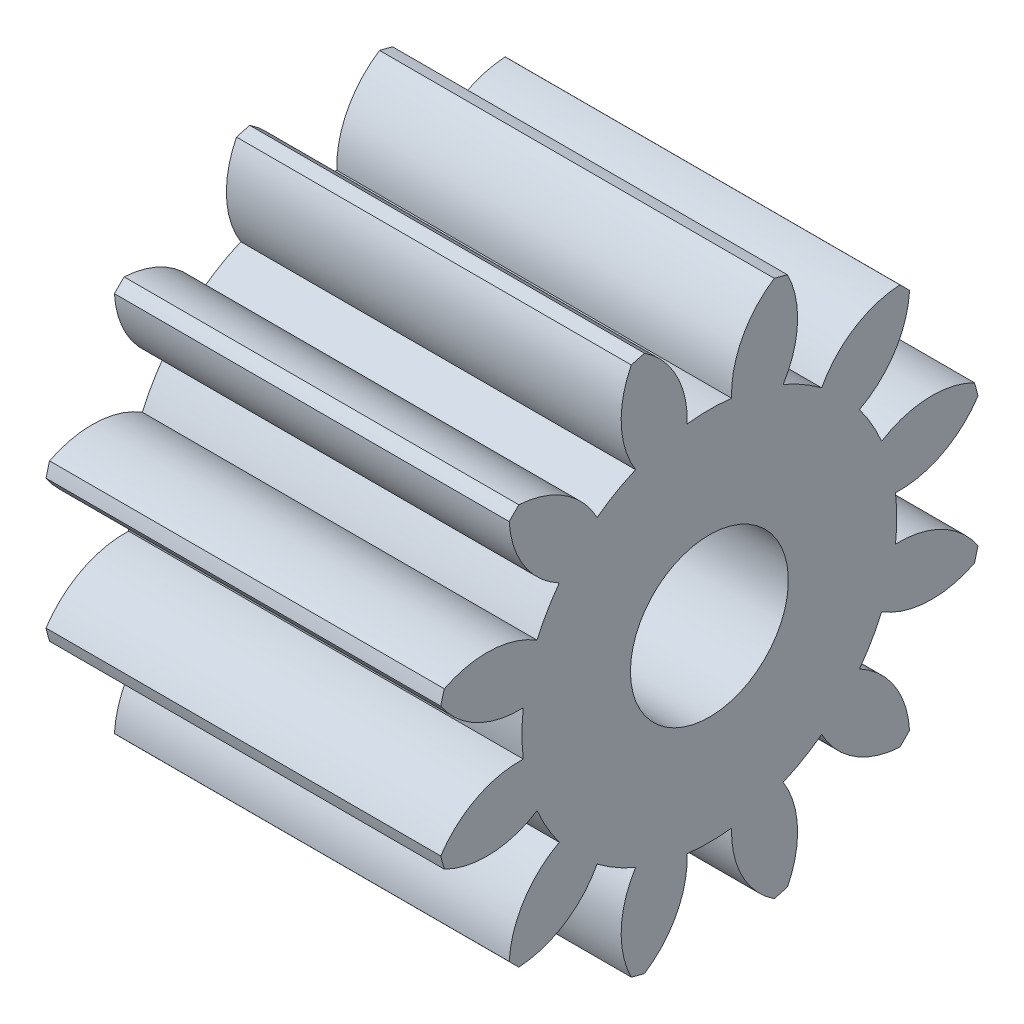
from build123d import *

# Parameters (mm, degrees)
BASPROSKE_W     = 5
BASPROSKE_H     = 3.5
TOOTHCUT_DEPTH  = 8.03562364
TEETHCUTS_COUNT = 12
BORSKE_R        = 1
BORE_DEPTH      = 50.0000508


with BuildPart() as part:
    # BasProSke → Base-Revolve (revolve)
    with BuildSketch(Plane(origin=(0, 0, 0), x_dir=(1, 0, 0), z_dir=(0, 1, 0)), mode=Mode.PRIVATE) as base_revolve_sk:
        with Locations((2.5, 1.75)):
            Rectangle(BASPROSKE_W, BASPROSKE_H)
    revolve(base_revolve_sk.sketch.rotate(Axis((-10, 0, 0), (1, 0, 0)), 180), axis=Axis((-10, 0, 0), (1, 0, 0)))

    # TooCutSke → ToothCut (cut, through all)
    with BuildSketch(Plane(origin=(0, 0, 0), x_dir=(0, 0, -1), z_dir=(1, 0, 0))):
        with BuildLine():
            ThreePointArc((0.281121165, 2.357296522), (0, 2.374), (-0.281121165, 2.357296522))
            ThreePointArc((-0.281121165, 2.357296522), (-0.422795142, 2.966088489), (-0.851415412, 3.421043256))
            ThreePointArc((-0.851415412, 3.421043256), (0, 3.5254), (0.851415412, 3.421043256))
            ThreePointArc((0.851415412, 3.421043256), (0.422795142, 2.966088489), (0.281121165, 2.357296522))
        make_face()
    toothcut = extrude(amount=TOOTHCUT_DEPTH, mode=Mode.SUBTRACT)

    # TeethCuts: ToothCut ×12 about axis
    teethcuts_axis = Axis((0, 0, 0), (1, 0, 0))
    for i in range(1, TEETHCUTS_COUNT):
        add(toothcut.rotate(teethcuts_axis, i * 360 / TEETHCUTS_COUNT), mode=Mode.SUBTRACT)

    # BorSke → Bore (cut, symmetric)
    with BuildSketch(Plane(origin=(0, 0, 0), x_dir=(0, 0, -1), z_dir=(1, 0, 0))):
        with Locations(Location((0, 0, 0), (0, 0, 180))):
            Circle(BORSKE_R)
    extrude(amount=BORE_DEPTH, both=True, mode=Mode.SUBTRACT)


solid = part.part
